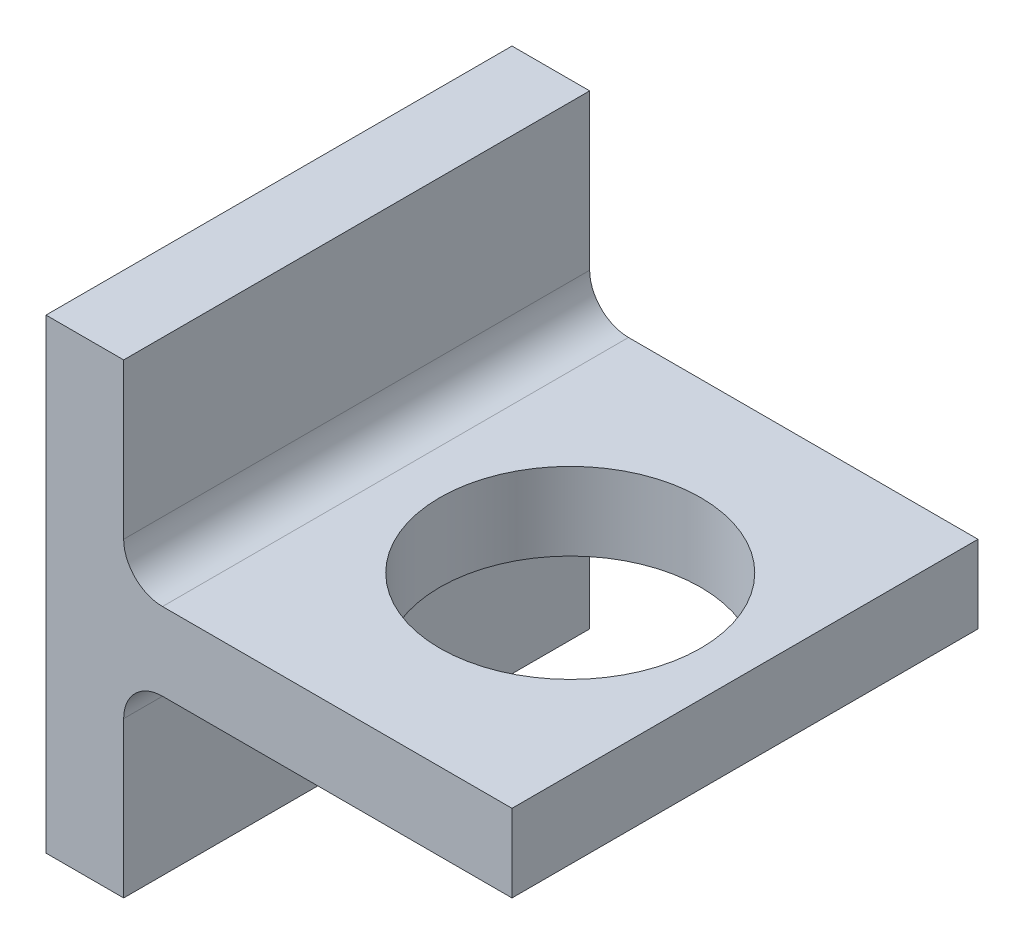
ISO-10303-21;
HEADER;
FILE_DESCRIPTION(('STEP AP214'),'2;1');
FILE_NAME('part.step','',(''),(''),'','','');
FILE_SCHEMA(('AUTOMOTIVE_DESIGN { 1 0 10303 214 1 1 1 1 }'));
ENDSEC;
DATA;
#1=APPLICATION_CONTEXT('core data for automotive mechanical design processes');
#2=APPLICATION_PROTOCOL_DEFINITION('international standard','automotive_design',2000,#1);
#3=PRODUCT_CONTEXT('',#1,'mechanical');
#4=PRODUCT('Part','Part','',(#3));
#5=PRODUCT_RELATED_PRODUCT_CATEGORY('part','',(#4));
#6=PRODUCT_DEFINITION_FORMATION('','',#4);
#7=PRODUCT_DEFINITION_CONTEXT('part definition',#1,'design');
#8=PRODUCT_DEFINITION('design','',#6,#7);
#9=PRODUCT_DEFINITION_SHAPE('','',#8);
#10=(LENGTH_UNIT() NAMED_UNIT(*) SI_UNIT(.MILLI.,.METRE.));
#11=(NAMED_UNIT(*) PLANE_ANGLE_UNIT() SI_UNIT($,.RADIAN.));
#12=(NAMED_UNIT(*) SI_UNIT($,.STERADIAN.) SOLID_ANGLE_UNIT());
#13=UNCERTAINTY_MEASURE_WITH_UNIT(LENGTH_MEASURE(1.E-05),#10,'distance_accuracy_value','');
#14=(GEOMETRIC_REPRESENTATION_CONTEXT(3) GLOBAL_UNCERTAINTY_ASSIGNED_CONTEXT((#13)) GLOBAL_UNIT_ASSIGNED_CONTEXT((#10,
#11,#12)) REPRESENTATION_CONTEXT('',''));
#15=CARTESIAN_POINT('',(0.,0.,0.));
#16=DIRECTION('',(0.,0.,1.));
#17=DIRECTION('',(1.,0.,0.));
#18=AXIS2_PLACEMENT_3D('',#15,#16,#17);
#19=CARTESIAN_POINT('',(0.,0.,120.));
#20=DIRECTION('',(1.,0.,0.));
#21=DIRECTION('',(0.,0.,-1.));
#22=AXIS2_PLACEMENT_3D('',#19,#20,#21);
#23=PLANE('',#22);
#24=DIRECTION('',(0.,-1.,0.));
#25=VECTOR('',#24,1.);
#26=CARTESIAN_POINT('',(0.,0.,0.));
#27=LINE('',#26,#25);
#28=CARTESIAN_POINT('',(0.,120.,0.));
#29=VERTEX_POINT('',#28);
#30=CARTESIAN_POINT('',(0.,0.,0.));
#31=VERTEX_POINT('',#30);
#32=EDGE_CURVE('E108',#29,#31,#27,.T.);
#33=ORIENTED_EDGE('',*,*,#32,.T.);
#34=DIRECTION('',(0.,0.,-1.));
#35=VECTOR('',#34,1.);
#36=CARTESIAN_POINT('',(0.,0.,120.));
#37=LINE('',#36,#35);
#38=CARTESIAN_POINT('',(0.,0.,120.));
#39=VERTEX_POINT('',#38);
#40=EDGE_CURVE('E11',#39,#31,#37,.T.);
#41=ORIENTED_EDGE('',*,*,#40,.F.);
#42=DIRECTION('',(0.,-1.,0.));
#43=VECTOR('',#42,1.);
#44=CARTESIAN_POINT('',(0.,0.,120.));
#45=LINE('',#44,#43);
#46=CARTESIAN_POINT('',(0.,120.,120.));
#47=VERTEX_POINT('',#46);
#48=EDGE_CURVE('E144',#47,#39,#45,.T.);
#49=ORIENTED_EDGE('',*,*,#48,.F.);
#50=DIRECTION('',(0.,0.,-1.));
#51=VECTOR('',#50,1.);
#52=CARTESIAN_POINT('',(0.,120.,120.));
#53=LINE('',#52,#51);
#54=EDGE_CURVE('E121',#47,#29,#53,.T.);
#55=ORIENTED_EDGE('',*,*,#54,.T.);
#56=EDGE_LOOP('',(#33,#41,#49,#55));
#57=FACE_BOUND('',#56,.T.);
#58=ADVANCED_FACE('F28',(#57),#23,.F.);
#59=CARTESIAN_POINT('',(0.,0.,120.));
#60=DIRECTION('',(0.,1.,0.));
#61=DIRECTION('',(0.,0.,1.));
#62=AXIS2_PLACEMENT_3D('',#59,#60,#61);
#63=PLANE('',#62);
#64=DIRECTION('',(1.,0.,0.));
#65=VECTOR('',#64,1.);
#66=CARTESIAN_POINT('',(0.,0.,0.));
#67=LINE('',#66,#65);
#68=CARTESIAN_POINT('',(20.,0.,0.));
#69=VERTEX_POINT('',#68);
#70=EDGE_CURVE('E104',#31,#69,#67,.T.);
#71=ORIENTED_EDGE('',*,*,#70,.T.);
#72=DIRECTION('',(0.,0.,-1.));
#73=VECTOR('',#72,1.);
#74=CARTESIAN_POINT('',(20.,0.,120.));
#75=LINE('',#74,#73);
#76=CARTESIAN_POINT('',(20.,0.,120.));
#77=VERTEX_POINT('',#76);
#78=EDGE_CURVE('E35',#77,#69,#75,.T.);
#79=ORIENTED_EDGE('',*,*,#78,.F.);
#80=DIRECTION('',(1.,0.,0.));
#81=VECTOR('',#80,1.);
#82=CARTESIAN_POINT('',(0.,0.,120.));
#83=LINE('',#82,#81);
#84=EDGE_CURVE('E117',#39,#77,#83,.T.);
#85=ORIENTED_EDGE('',*,*,#84,.F.);
#86=ORIENTED_EDGE('',*,*,#40,.T.);
#87=EDGE_LOOP('',(#71,#79,#85,#86));
#88=FACE_BOUND('',#87,.T.);
#89=ADVANCED_FACE('F116',(#88),#63,.F.);
#90=CARTESIAN_POINT('',(20.,0.,120.));
#91=DIRECTION('',(-1.,0.,0.));
#92=DIRECTION('',(0.,0.,1.));
#93=AXIS2_PLACEMENT_3D('',#90,#91,#92);
#94=PLANE('',#93);
#95=DIRECTION('',(0.,1.,0.));
#96=VECTOR('',#95,1.);
#97=CARTESIAN_POINT('',(20.,0.,0.));
#98=LINE('',#97,#96);
#99=CARTESIAN_POINT('',(20.,40.,0.));
#100=VERTEX_POINT('',#99);
#101=EDGE_CURVE('E110',#69,#100,#98,.T.);
#102=ORIENTED_EDGE('',*,*,#101,.T.);
#103=DIRECTION('',(0.,0.,-1.));
#104=VECTOR('',#103,1.);
#105=CARTESIAN_POINT('',(20.,40.,120.));
#106=LINE('',#105,#104);
#107=CARTESIAN_POINT('',(20.,40.,120.));
#108=VERTEX_POINT('',#107);
#109=EDGE_CURVE('E180',#108,#100,#106,.T.);
#110=ORIENTED_EDGE('',*,*,#109,.F.);
#111=DIRECTION('',(0.,1.,0.));
#112=VECTOR('',#111,1.);
#113=CARTESIAN_POINT('',(20.,0.,120.));
#114=LINE('',#113,#112);
#115=EDGE_CURVE('E147',#77,#108,#114,.T.);
#116=ORIENTED_EDGE('',*,*,#115,.F.);
#117=ORIENTED_EDGE('',*,*,#78,.T.);
#118=EDGE_LOOP('',(#102,#110,#116,#117));
#119=FACE_BOUND('',#118,.T.);
#120=ADVANCED_FACE('F184',(#119),#94,.F.);
#121=CARTESIAN_POINT('',(30.,40.,120.));
#122=DIRECTION('',(0.,0.,-1.));
#123=DIRECTION('',(-1.,0.,0.));
#124=AXIS2_PLACEMENT_3D('',#121,#122,#123);
#125=CYLINDRICAL_SURFACE('',#124,10.);
#126=CARTESIAN_POINT('',(30.,40.,0.));
#127=DIRECTION('',(0.,0.,-1.));
#128=DIRECTION('',(-1.,0.,0.));
#129=AXIS2_PLACEMENT_3D('',#126,#127,#128);
#130=CIRCLE('',#129,10.);
#131=CARTESIAN_POINT('',(30.,50.,0.));
#132=VERTEX_POINT('',#131);
#133=EDGE_CURVE('E130',#100,#132,#130,.T.);
#134=ORIENTED_EDGE('',*,*,#133,.T.);
#135=DIRECTION('',(0.,0.,-1.));
#136=VECTOR('',#135,1.);
#137=CARTESIAN_POINT('',(30.,50.,120.));
#138=LINE('',#137,#136);
#139=CARTESIAN_POINT('',(30.,50.,120.));
#140=VERTEX_POINT('',#139);
#141=EDGE_CURVE('E177',#140,#132,#138,.T.);
#142=ORIENTED_EDGE('',*,*,#141,.F.);
#143=CARTESIAN_POINT('',(30.,40.,120.));
#144=DIRECTION('',(0.,0.,-1.));
#145=DIRECTION('',(-1.,0.,0.));
#146=AXIS2_PLACEMENT_3D('',#143,#144,#145);
#147=CIRCLE('',#146,10.);
#148=EDGE_CURVE('E149',#108,#140,#147,.T.);
#149=ORIENTED_EDGE('',*,*,#148,.F.);
#150=ORIENTED_EDGE('',*,*,#109,.T.);
#151=EDGE_LOOP('',(#134,#142,#149,#150));
#152=FACE_BOUND('',#151,.T.);
#153=ADVANCED_FACE('F192',(#152),#125,.F.);
#154=CARTESIAN_POINT('',(30.,50.,120.));
#155=DIRECTION('',(0.,1.,0.));
#156=DIRECTION('',(-1.,0.,0.));
#157=AXIS2_PLACEMENT_3D('',#154,#155,#156);
#158=PLANE('',#157);
#159=CARTESIAN_POINT('',(75.,50.,60.));
#160=DIRECTION('',(0.,1.,0.));
#161=DIRECTION('',(-1.,0.,0.));
#162=AXIS2_PLACEMENT_3D('',#159,#160,#161);
#163=CIRCLE('',#162,33.6);
#164=CARTESIAN_POINT('',(41.4,50.,60.));
#165=VERTEX_POINT('',#164);
#166=EDGE_CURVE('E122',#165,#165,#163,.T.);
#167=ORIENTED_EDGE('',*,*,#166,.T.);
#168=EDGE_LOOP('',(#167));
#169=FACE_BOUND('',#168,.T.);
#170=DIRECTION('',(1.,0.,0.));
#171=VECTOR('',#170,1.);
#172=CARTESIAN_POINT('',(30.,50.,0.));
#173=LINE('',#172,#171);
#174=CARTESIAN_POINT('',(120.,50.,0.));
#175=VERTEX_POINT('',#174);
#176=EDGE_CURVE('E132',#132,#175,#173,.T.);
#177=ORIENTED_EDGE('',*,*,#176,.T.);
#178=DIRECTION('',(0.,0.,-1.));
#179=VECTOR('',#178,1.);
#180=CARTESIAN_POINT('',(120.,50.,120.));
#181=LINE('',#180,#179);
#182=CARTESIAN_POINT('',(120.,50.,120.));
#183=VERTEX_POINT('',#182);
#184=EDGE_CURVE('E174',#183,#175,#181,.T.);
#185=ORIENTED_EDGE('',*,*,#184,.F.);
#186=DIRECTION('',(1.,0.,0.));
#187=VECTOR('',#186,1.);
#188=CARTESIAN_POINT('',(30.,50.,120.));
#189=LINE('',#188,#187);
#190=EDGE_CURVE('E151',#140,#183,#189,.T.);
#191=ORIENTED_EDGE('',*,*,#190,.F.);
#192=ORIENTED_EDGE('',*,*,#141,.T.);
#193=EDGE_LOOP('',(#177,#185,#191,#192));
#194=FACE_BOUND('',#193,.T.);
#195=ADVANCED_FACE('F195',(#169,#194),#158,.F.);
#196=CARTESIAN_POINT('',(120.,70.,120.));
#197=DIRECTION('',(-1.,0.,0.));
#198=DIRECTION('',(0.,0.,1.));
#199=AXIS2_PLACEMENT_3D('',#196,#197,#198);
#200=PLANE('',#199);
#201=DIRECTION('',(0.,1.,0.));
#202=VECTOR('',#201,1.);
#203=CARTESIAN_POINT('',(120.,70.,0.));
#204=LINE('',#203,#202);
#205=CARTESIAN_POINT('',(120.,70.,0.));
#206=VERTEX_POINT('',#205);
#207=EDGE_CURVE('E134',#175,#206,#204,.T.);
#208=ORIENTED_EDGE('',*,*,#207,.T.);
#209=DIRECTION('',(0.,0.,-1.));
#210=VECTOR('',#209,1.);
#211=CARTESIAN_POINT('',(120.,70.,120.));
#212=LINE('',#211,#210);
#213=CARTESIAN_POINT('',(120.,70.,120.));
#214=VERTEX_POINT('',#213);
#215=EDGE_CURVE('E171',#214,#206,#212,.T.);
#216=ORIENTED_EDGE('',*,*,#215,.F.);
#217=DIRECTION('',(0.,1.,0.));
#218=VECTOR('',#217,1.);
#219=CARTESIAN_POINT('',(120.,70.,120.));
#220=LINE('',#219,#218);
#221=EDGE_CURVE('E153',#183,#214,#220,.T.);
#222=ORIENTED_EDGE('',*,*,#221,.F.);
#223=ORIENTED_EDGE('',*,*,#184,.T.);
#224=EDGE_LOOP('',(#208,#216,#222,#223));
#225=FACE_BOUND('',#224,.T.);
#226=ADVANCED_FACE('F200',(#225),#200,.F.);
#227=CARTESIAN_POINT('',(30.,70.,120.));
#228=DIRECTION('',(0.,-1.,0.));
#229=DIRECTION('',(0.,0.,-1.));
#230=AXIS2_PLACEMENT_3D('',#227,#228,#229);
#231=PLANE('',#230);
#232=CARTESIAN_POINT('',(75.,70.,60.));
#233=DIRECTION('',(0.,1.,0.));
#234=DIRECTION('',(0.,0.,1.));
#235=AXIS2_PLACEMENT_3D('',#232,#233,#234);
#236=CIRCLE('',#235,33.6);
#237=CARTESIAN_POINT('',(75.,70.,93.6));
#238=VERTEX_POINT('',#237);
#239=EDGE_CURVE('E125',#238,#238,#236,.T.);
#240=ORIENTED_EDGE('',*,*,#239,.F.);
#241=EDGE_LOOP('',(#240));
#242=FACE_BOUND('',#241,.T.);
#243=DIRECTION('',(-1.,0.,0.));
#244=VECTOR('',#243,1.);
#245=CARTESIAN_POINT('',(30.,70.,0.));
#246=LINE('',#245,#244);
#247=CARTESIAN_POINT('',(30.,70.,0.));
#248=VERTEX_POINT('',#247);
#249=EDGE_CURVE('E136',#206,#248,#246,.T.);
#250=ORIENTED_EDGE('',*,*,#249,.T.);
#251=DIRECTION('',(0.,0.,-1.));
#252=VECTOR('',#251,1.);
#253=CARTESIAN_POINT('',(30.,70.,120.));
#254=LINE('',#253,#252);
#255=CARTESIAN_POINT('',(30.,70.,120.));
#256=VERTEX_POINT('',#255);
#257=EDGE_CURVE('E168',#256,#248,#254,.T.);
#258=ORIENTED_EDGE('',*,*,#257,.F.);
#259=DIRECTION('',(-1.,0.,0.));
#260=VECTOR('',#259,1.);
#261=CARTESIAN_POINT('',(30.,70.,120.));
#262=LINE('',#261,#260);
#263=EDGE_CURVE('E155',#214,#256,#262,.T.);
#264=ORIENTED_EDGE('',*,*,#263,.F.);
#265=ORIENTED_EDGE('',*,*,#215,.T.);
#266=EDGE_LOOP('',(#250,#258,#264,#265));
#267=FACE_BOUND('',#266,.T.);
#268=ADVANCED_FACE('F206',(#242,#267),#231,.F.);
#269=CARTESIAN_POINT('',(30.,80.,120.));
#270=DIRECTION('',(0.,0.,-1.));
#271=DIRECTION('',(-1.,0.,0.));
#272=AXIS2_PLACEMENT_3D('',#269,#270,#271);
#273=CYLINDRICAL_SURFACE('',#272,10.);
#274=CARTESIAN_POINT('',(30.,80.,0.));
#275=DIRECTION('',(0.,0.,-1.));
#276=DIRECTION('',(-1.,0.,0.));
#277=AXIS2_PLACEMENT_3D('',#274,#275,#276);
#278=CIRCLE('',#277,10.);
#279=CARTESIAN_POINT('',(20.,80.,0.));
#280=VERTEX_POINT('',#279);
#281=EDGE_CURVE('E138',#248,#280,#278,.T.);
#282=ORIENTED_EDGE('',*,*,#281,.T.);
#283=DIRECTION('',(0.,0.,-1.));
#284=VECTOR('',#283,1.);
#285=CARTESIAN_POINT('',(20.,80.,120.));
#286=LINE('',#285,#284);
#287=CARTESIAN_POINT('',(20.,80.,120.));
#288=VERTEX_POINT('',#287);
#289=EDGE_CURVE('E165',#288,#280,#286,.T.);
#290=ORIENTED_EDGE('',*,*,#289,.F.);
#291=CARTESIAN_POINT('',(30.,80.,120.));
#292=DIRECTION('',(0.,0.,-1.));
#293=DIRECTION('',(-1.,0.,0.));
#294=AXIS2_PLACEMENT_3D('',#291,#292,#293);
#295=CIRCLE('',#294,10.);
#296=EDGE_CURVE('E157',#256,#288,#295,.T.);
#297=ORIENTED_EDGE('',*,*,#296,.F.);
#298=ORIENTED_EDGE('',*,*,#257,.T.);
#299=EDGE_LOOP('',(#282,#290,#297,#298));
#300=FACE_BOUND('',#299,.T.);
#301=ADVANCED_FACE('F210',(#300),#273,.F.);
#302=CARTESIAN_POINT('',(20.,80.,120.));
#303=DIRECTION('',(-1.,0.,0.));
#304=DIRECTION('',(0.,0.,1.));
#305=AXIS2_PLACEMENT_3D('',#302,#303,#304);
#306=PLANE('',#305);
#307=DIRECTION('',(0.,1.,0.));
#308=VECTOR('',#307,1.);
#309=CARTESIAN_POINT('',(20.,80.,0.));
#310=LINE('',#309,#308);
#311=CARTESIAN_POINT('',(20.,120.,0.));
#312=VERTEX_POINT('',#311);
#313=EDGE_CURVE('E140',#280,#312,#310,.T.);
#314=ORIENTED_EDGE('',*,*,#313,.T.);
#315=DIRECTION('',(0.,0.,-1.));
#316=VECTOR('',#315,1.);
#317=CARTESIAN_POINT('',(20.,120.,120.));
#318=LINE('',#317,#316);
#319=CARTESIAN_POINT('',(20.,120.,120.));
#320=VERTEX_POINT('',#319);
#321=EDGE_CURVE('E162',#320,#312,#318,.T.);
#322=ORIENTED_EDGE('',*,*,#321,.F.);
#323=DIRECTION('',(0.,1.,0.));
#324=VECTOR('',#323,1.);
#325=CARTESIAN_POINT('',(20.,80.,120.));
#326=LINE('',#325,#324);
#327=EDGE_CURVE('E47',#288,#320,#326,.T.);
#328=ORIENTED_EDGE('',*,*,#327,.F.);
#329=ORIENTED_EDGE('',*,*,#289,.T.);
#330=EDGE_LOOP('',(#314,#322,#328,#329));
#331=FACE_BOUND('',#330,.T.);
#332=ADVANCED_FACE('F213',(#331),#306,.F.);
#333=CARTESIAN_POINT('',(0.,120.,120.));
#334=DIRECTION('',(0.,-1.,0.));
#335=DIRECTION('',(0.,0.,-1.));
#336=AXIS2_PLACEMENT_3D('',#333,#334,#335);
#337=PLANE('',#336);
#338=DIRECTION('',(-1.,0.,0.));
#339=VECTOR('',#338,1.);
#340=CARTESIAN_POINT('',(0.,120.,0.));
#341=LINE('',#340,#339);
#342=EDGE_CURVE('E142',#312,#29,#341,.T.);
#343=ORIENTED_EDGE('',*,*,#342,.T.);
#344=ORIENTED_EDGE('',*,*,#54,.F.);
#345=DIRECTION('',(-1.,0.,0.));
#346=VECTOR('',#345,1.);
#347=CARTESIAN_POINT('',(0.,120.,120.));
#348=LINE('',#347,#346);
#349=EDGE_CURVE('E42',#320,#47,#348,.T.);
#350=ORIENTED_EDGE('',*,*,#349,.F.);
#351=ORIENTED_EDGE('',*,*,#321,.T.);
#352=EDGE_LOOP('',(#343,#344,#350,#351));
#353=FACE_BOUND('',#352,.T.);
#354=ADVANCED_FACE('F215',(#353),#337,.F.);
#355=CARTESIAN_POINT('',(30.,80.,120.));
#356=DIRECTION('',(0.,0.,-1.));
#357=DIRECTION('',(-1.,0.,0.));
#358=AXIS2_PLACEMENT_3D('',#355,#356,#357);
#359=PLANE('',#358);
#360=ORIENTED_EDGE('',*,*,#48,.T.);
#361=ORIENTED_EDGE('',*,*,#84,.T.);
#362=ORIENTED_EDGE('',*,*,#115,.T.);
#363=ORIENTED_EDGE('',*,*,#148,.T.);
#364=ORIENTED_EDGE('',*,*,#190,.T.);
#365=ORIENTED_EDGE('',*,*,#221,.T.);
#366=ORIENTED_EDGE('',*,*,#263,.T.);
#367=ORIENTED_EDGE('',*,*,#296,.T.);
#368=ORIENTED_EDGE('',*,*,#327,.T.);
#369=ORIENTED_EDGE('',*,*,#349,.T.);
#370=EDGE_LOOP('',(#360,#361,#362,#363,#364,#365,#366,#367,#368,#369));
#371=FACE_BOUND('',#370,.T.);
#372=ADVANCED_FACE('F187',(#371),#359,.F.);
#373=CARTESIAN_POINT('',(30.,80.,0.));
#374=DIRECTION('',(0.,0.,-1.));
#375=DIRECTION('',(-1.,0.,0.));
#376=AXIS2_PLACEMENT_3D('',#373,#374,#375);
#377=PLANE('',#376);
#378=ORIENTED_EDGE('',*,*,#32,.F.);
#379=ORIENTED_EDGE('',*,*,#342,.F.);
#380=ORIENTED_EDGE('',*,*,#313,.F.);
#381=ORIENTED_EDGE('',*,*,#281,.F.);
#382=ORIENTED_EDGE('',*,*,#249,.F.);
#383=ORIENTED_EDGE('',*,*,#207,.F.);
#384=ORIENTED_EDGE('',*,*,#176,.F.);
#385=ORIENTED_EDGE('',*,*,#133,.F.);
#386=ORIENTED_EDGE('',*,*,#101,.F.);
#387=ORIENTED_EDGE('',*,*,#70,.F.);
#388=EDGE_LOOP('',(#378,#379,#380,#381,#382,#383,#384,#385,#386,#387));
#389=FACE_BOUND('',#388,.T.);
#390=ADVANCED_FACE('F105',(#389),#377,.T.);
#391=CARTESIAN_POINT('',(75.,0.,60.));
#392=DIRECTION('',(0.,1.,0.));
#393=DIRECTION('',(0.,0.,1.));
#394=AXIS2_PLACEMENT_3D('',#391,#392,#393);
#395=CYLINDRICAL_SURFACE('',#394,33.6);
#396=ORIENTED_EDGE('',*,*,#239,.T.);
#397=EDGE_LOOP('',(#396));
#398=FACE_BOUND('',#397,.T.);
#399=ORIENTED_EDGE('',*,*,#166,.F.);
#400=EDGE_LOOP('',(#399));
#401=FACE_BOUND('',#400,.T.);
#402=ADVANCED_FACE('F266',(#398,#401),#395,.F.);
#403=CLOSED_SHELL('',(#58,#89,#120,#153,#195,#226,#268,#301,#332,#354,#372,#390,#402));
#404=MANIFOLD_SOLID_BREP('B2',#403);
#405=ADVANCED_BREP_SHAPE_REPRESENTATION('',(#18,#404),#14);
#406=SHAPE_DEFINITION_REPRESENTATION(#9,#405);
ENDSEC;
END-ISO-10303-21;
